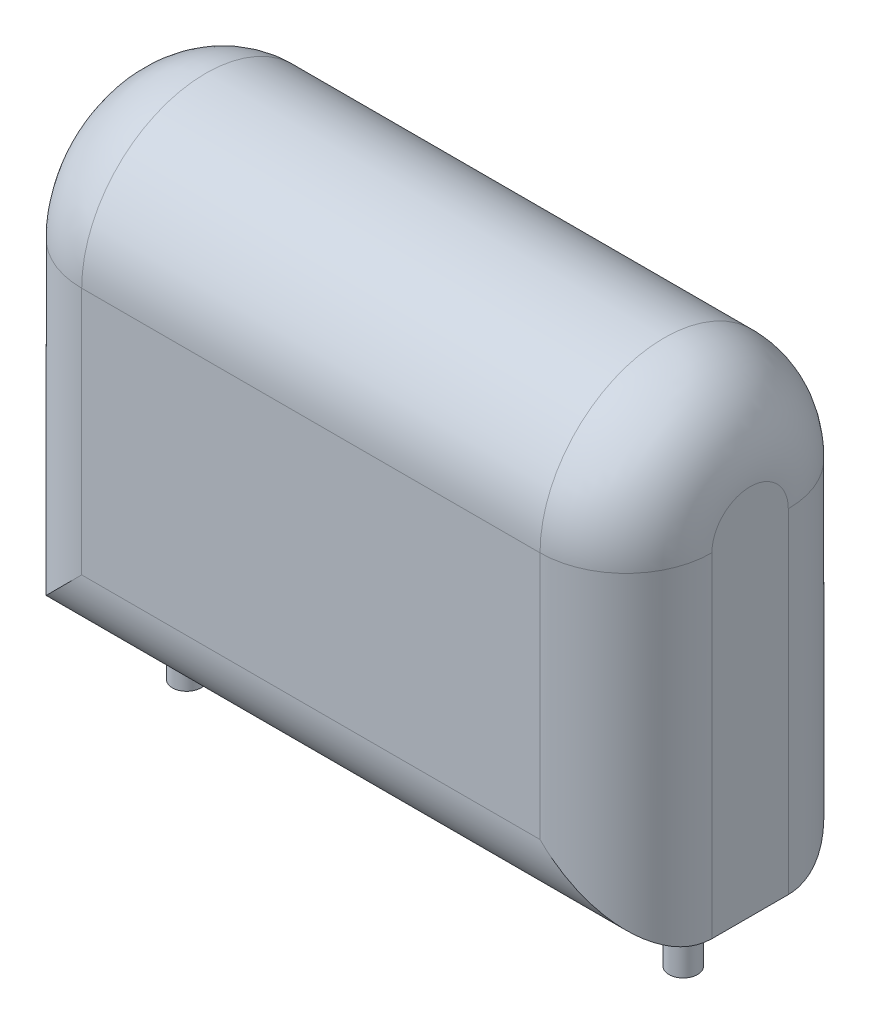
ISO-10303-21;
HEADER;
FILE_DESCRIPTION(('STEP AP214'),'2;1');
FILE_NAME('part.step','',(''),(''),'','','');
FILE_SCHEMA(('AUTOMOTIVE_DESIGN { 1 0 10303 214 1 1 1 1 }'));
ENDSEC;
DATA;
#1=APPLICATION_CONTEXT('core data for automotive mechanical design processes');
#2=APPLICATION_PROTOCOL_DEFINITION('international standard','automotive_design',2000,#1);
#3=PRODUCT_CONTEXT('',#1,'mechanical');
#4=PRODUCT('Part','Part','',(#3));
#5=PRODUCT_RELATED_PRODUCT_CATEGORY('part','',(#4));
#6=PRODUCT_DEFINITION_FORMATION('','',#4);
#7=PRODUCT_DEFINITION_CONTEXT('part definition',#1,'design');
#8=PRODUCT_DEFINITION('design','',#6,#7);
#9=PRODUCT_DEFINITION_SHAPE('','',#8);
#10=(LENGTH_UNIT() NAMED_UNIT(*) SI_UNIT(.MILLI.,.METRE.));
#11=(NAMED_UNIT(*) PLANE_ANGLE_UNIT() SI_UNIT($,.RADIAN.));
#12=(NAMED_UNIT(*) SI_UNIT($,.STERADIAN.) SOLID_ANGLE_UNIT());
#13=UNCERTAINTY_MEASURE_WITH_UNIT(LENGTH_MEASURE(1.E-05),#10,'distance_accuracy_value','');
#14=(GEOMETRIC_REPRESENTATION_CONTEXT(3) GLOBAL_UNCERTAINTY_ASSIGNED_CONTEXT((#13)) GLOBAL_UNIT_ASSIGNED_CONTEXT((#10,
#11,#12)) REPRESENTATION_CONTEXT('',''));
#15=CARTESIAN_POINT('',(0.,0.,0.));
#16=DIRECTION('',(0.,0.,1.));
#17=DIRECTION('',(1.,0.,0.));
#18=AXIS2_PLACEMENT_3D('',#15,#16,#17);
#19=CARTESIAN_POINT('',(6.5,-2.,0.));
#20=DIRECTION('',(0.,1.,0.));
#21=DIRECTION('',(0.,0.,1.));
#22=AXIS2_PLACEMENT_3D('',#19,#20,#21);
#23=CYLINDRICAL_SURFACE('',#22,0.375);
#24=CARTESIAN_POINT('',(6.5,0.,0.));
#25=DIRECTION('',(0.,-1.,0.));
#26=DIRECTION('',(0.,0.,1.));
#27=AXIS2_PLACEMENT_3D('',#24,#25,#26);
#28=CIRCLE('',#27,0.375);
#29=CARTESIAN_POINT('',(6.5,0.,0.375));
#30=VERTEX_POINT('',#29);
#31=EDGE_CURVE('E11',#30,#30,#28,.T.);
#32=ORIENTED_EDGE('',*,*,#31,.T.);
#33=EDGE_LOOP('',(#32));
#34=FACE_BOUND('',#33,.T.);
#35=CARTESIAN_POINT('',(6.5,-2.,0.));
#36=DIRECTION('',(0.,-1.,0.));
#37=DIRECTION('',(0.,0.,1.));
#38=AXIS2_PLACEMENT_3D('',#35,#36,#37);
#39=CIRCLE('',#38,0.375);
#40=CARTESIAN_POINT('',(6.5,-2.,0.375));
#41=VERTEX_POINT('',#40);
#42=EDGE_CURVE('E139',#41,#41,#39,.T.);
#43=ORIENTED_EDGE('',*,*,#42,.F.);
#44=EDGE_LOOP('',(#43));
#45=FACE_BOUND('',#44,.T.);
#46=ADVANCED_FACE('F17',(#34,#45),#23,.T.);
#47=CARTESIAN_POINT('',(-6.5,-2.,0.));
#48=DIRECTION('',(0.,1.,0.));
#49=DIRECTION('',(0.,0.,1.));
#50=AXIS2_PLACEMENT_3D('',#47,#48,#49);
#51=CYLINDRICAL_SURFACE('',#50,0.375);
#52=CARTESIAN_POINT('',(-6.5,0.,0.));
#53=DIRECTION('',(0.,-1.,0.));
#54=DIRECTION('',(0.,0.,1.));
#55=AXIS2_PLACEMENT_3D('',#52,#53,#54);
#56=CIRCLE('',#55,0.375);
#57=CARTESIAN_POINT('',(-6.5,0.,0.375));
#58=VERTEX_POINT('',#57);
#59=EDGE_CURVE('E29',#58,#58,#56,.T.);
#60=ORIENTED_EDGE('',*,*,#59,.T.);
#61=EDGE_LOOP('',(#60));
#62=FACE_BOUND('',#61,.T.);
#63=CARTESIAN_POINT('',(-6.5,-2.,0.));
#64=DIRECTION('',(0.,-1.,0.));
#65=DIRECTION('',(0.,0.,-1.));
#66=AXIS2_PLACEMENT_3D('',#63,#64,#65);
#67=CIRCLE('',#66,0.375);
#68=CARTESIAN_POINT('',(-6.5,-2.,-0.375));
#69=VERTEX_POINT('',#68);
#70=EDGE_CURVE('E136',#69,#69,#67,.T.);
#71=ORIENTED_EDGE('',*,*,#70,.F.);
#72=EDGE_LOOP('',(#71));
#73=FACE_BOUND('',#72,.T.);
#74=ADVANCED_FACE('F229',(#62,#73),#51,.T.);
#75=CARTESIAN_POINT('',(-8.25,0.,3.25));
#76=DIRECTION('',(0.,1.,0.));
#77=DIRECTION('',(0.,0.,1.));
#78=AXIS2_PLACEMENT_3D('',#75,#76,#77);
#79=PLANE('',#78);
#80=ORIENTED_EDGE('',*,*,#59,.F.);
#81=EDGE_LOOP('',(#80));
#82=FACE_BOUND('',#81,.T.);
#83=DIRECTION('',(0.,0.,1.));
#84=VECTOR('',#83,1.);
#85=CARTESIAN_POINT('',(-8.25,0.,-3.25));
#86=LINE('',#85,#84);
#87=CARTESIAN_POINT('',(-8.25,0.,-1.));
#88=VERTEX_POINT('',#87);
#89=CARTESIAN_POINT('',(-8.25,0.,0.999999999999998));
#90=VERTEX_POINT('',#89);
#91=EDGE_CURVE('E38',#88,#90,#86,.T.);
#92=ORIENTED_EDGE('',*,*,#91,.F.);
#93=DIRECTION('',(1.,0.,0.));
#94=VECTOR('',#93,1.);
#95=CARTESIAN_POINT('',(-8.25,0.,-1.));
#96=LINE('',#95,#94);
#97=CARTESIAN_POINT('',(8.25,0.,-1.));
#98=VERTEX_POINT('',#97);
#99=EDGE_CURVE('E148',#88,#98,#96,.T.);
#100=ORIENTED_EDGE('',*,*,#99,.T.);
#101=DIRECTION('',(0.,0.,-1.));
#102=VECTOR('',#101,1.);
#103=CARTESIAN_POINT('',(8.25,0.,-3.25));
#104=LINE('',#103,#102);
#105=CARTESIAN_POINT('',(8.25,0.,0.999999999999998));
#106=VERTEX_POINT('',#105);
#107=EDGE_CURVE('E154',#106,#98,#104,.T.);
#108=ORIENTED_EDGE('',*,*,#107,.F.);
#109=DIRECTION('',(-1.,0.,0.));
#110=VECTOR('',#109,1.);
#111=CARTESIAN_POINT('',(-8.25,0.,1.));
#112=LINE('',#111,#110);
#113=EDGE_CURVE('E153',#106,#90,#112,.T.);
#114=ORIENTED_EDGE('',*,*,#113,.T.);
#115=EDGE_LOOP('',(#92,#100,#108,#114));
#116=FACE_BOUND('',#115,.T.);
#117=ORIENTED_EDGE('',*,*,#31,.F.);
#118=EDGE_LOOP('',(#117));
#119=FACE_BOUND('',#118,.T.);
#120=ADVANCED_FACE('F212',(#82,#116,#119),#79,.F.);
#121=CARTESIAN_POINT('',(-8.25,12.,-3.25));
#122=DIRECTION('',(1.,0.,0.));
#123=DIRECTION('',(0.,0.,-1.));
#124=AXIS2_PLACEMENT_3D('',#121,#122,#123);
#125=PLANE('',#124);
#126=CARTESIAN_POINT('',(-8.25,8.75,0.));
#127=DIRECTION('',(-1.,0.,0.));
#128=DIRECTION('',(0.,0.,-1.));
#129=AXIS2_PLACEMENT_3D('',#126,#127,#128);
#130=CIRCLE('',#129,1.);
#131=CARTESIAN_POINT('',(-8.25,8.75,1.));
#132=VERTEX_POINT('',#131);
#133=CARTESIAN_POINT('',(-8.25,8.75,-1.));
#134=VERTEX_POINT('',#133);
#135=EDGE_CURVE('E160',#132,#134,#130,.T.);
#136=ORIENTED_EDGE('',*,*,#135,.T.);
#137=DIRECTION('',(0.,-1.,0.));
#138=VECTOR('',#137,1.);
#139=CARTESIAN_POINT('',(-8.25,12.,-1.));
#140=LINE('',#139,#138);
#141=EDGE_CURVE('E150',#134,#88,#140,.T.);
#142=ORIENTED_EDGE('',*,*,#141,.T.);
#143=ORIENTED_EDGE('',*,*,#91,.T.);
#144=DIRECTION('',(0.,1.,0.));
#145=VECTOR('',#144,1.);
#146=CARTESIAN_POINT('',(-8.25,12.,1.));
#147=LINE('',#146,#145);
#148=EDGE_CURVE('E151',#90,#132,#147,.T.);
#149=ORIENTED_EDGE('',*,*,#148,.T.);
#150=EDGE_LOOP('',(#136,#142,#143,#149));
#151=FACE_BOUND('',#150,.T.);
#152=ADVANCED_FACE('F209',(#151),#125,.F.);
#153=CARTESIAN_POINT('',(-8.25,12.,3.25));
#154=DIRECTION('',(0.,0.,-1.));
#155=DIRECTION('',(-1.,0.,0.));
#156=AXIS2_PLACEMENT_3D('',#153,#154,#155);
#157=PLANE('',#156);
#158=DIRECTION('',(-1.,0.,0.));
#159=VECTOR('',#158,1.);
#160=CARTESIAN_POINT('',(-8.25,8.75,3.25));
#161=LINE('',#160,#159);
#162=CARTESIAN_POINT('',(6.,8.75,3.25));
#163=VERTEX_POINT('',#162);
#164=CARTESIAN_POINT('',(-6.,8.75,3.25));
#165=VERTEX_POINT('',#164);
#166=EDGE_CURVE('E95',#163,#165,#161,.T.);
#167=ORIENTED_EDGE('',*,*,#166,.T.);
#168=DIRECTION('',(0.,-1.,0.));
#169=VECTOR('',#168,1.);
#170=CARTESIAN_POINT('',(-6.,12.,3.25));
#171=LINE('',#170,#169);
#172=CARTESIAN_POINT('',(-6.,2.25,3.25));
#173=VERTEX_POINT('',#172);
#174=EDGE_CURVE('E167',#165,#173,#171,.T.);
#175=ORIENTED_EDGE('',*,*,#174,.T.);
#176=DIRECTION('',(1.,0.,0.));
#177=VECTOR('',#176,1.);
#178=CARTESIAN_POINT('',(-8.25,2.25,3.25));
#179=LINE('',#178,#177);
#180=CARTESIAN_POINT('',(6.,2.25,3.25));
#181=VERTEX_POINT('',#180);
#182=EDGE_CURVE('E170',#173,#181,#179,.T.);
#183=ORIENTED_EDGE('',*,*,#182,.T.);
#184=DIRECTION('',(0.,1.,0.));
#185=VECTOR('',#184,1.);
#186=CARTESIAN_POINT('',(6.,12.,3.25));
#187=LINE('',#186,#185);
#188=EDGE_CURVE('E157',#181,#163,#187,.T.);
#189=ORIENTED_EDGE('',*,*,#188,.T.);
#190=EDGE_LOOP('',(#167,#175,#183,#189));
#191=FACE_BOUND('',#190,.T.);
#192=ADVANCED_FACE('F206',(#191),#157,.F.);
#193=CARTESIAN_POINT('',(8.25,12.,-3.25));
#194=DIRECTION('',(-1.,0.,0.));
#195=DIRECTION('',(0.,0.,1.));
#196=AXIS2_PLACEMENT_3D('',#193,#194,#195);
#197=PLANE('',#196);
#198=ORIENTED_EDGE('',*,*,#107,.T.);
#199=DIRECTION('',(0.,1.,0.));
#200=VECTOR('',#199,1.);
#201=CARTESIAN_POINT('',(8.25,12.,-1.));
#202=LINE('',#201,#200);
#203=CARTESIAN_POINT('',(8.25,8.75,-1.));
#204=VERTEX_POINT('',#203);
#205=EDGE_CURVE('E158',#98,#204,#202,.T.);
#206=ORIENTED_EDGE('',*,*,#205,.T.);
#207=CARTESIAN_POINT('',(8.25,8.75,0.));
#208=DIRECTION('',(1.,0.,0.));
#209=DIRECTION('',(0.,0.,1.));
#210=AXIS2_PLACEMENT_3D('',#207,#208,#209);
#211=CIRCLE('',#210,1.);
#212=CARTESIAN_POINT('',(8.25,8.75,1.));
#213=VERTEX_POINT('',#212);
#214=EDGE_CURVE('E120',#204,#213,#211,.T.);
#215=ORIENTED_EDGE('',*,*,#214,.T.);
#216=DIRECTION('',(0.,-1.,0.));
#217=VECTOR('',#216,1.);
#218=CARTESIAN_POINT('',(8.25,12.,1.));
#219=LINE('',#218,#217);
#220=EDGE_CURVE('E176',#213,#106,#219,.T.);
#221=ORIENTED_EDGE('',*,*,#220,.T.);
#222=EDGE_LOOP('',(#198,#206,#215,#221));
#223=FACE_BOUND('',#222,.T.);
#224=ADVANCED_FACE('F215',(#223),#197,.F.);
#225=CARTESIAN_POINT('',(-8.25,12.,-3.25));
#226=DIRECTION('',(0.,0.,1.));
#227=DIRECTION('',(1.,0.,0.));
#228=AXIS2_PLACEMENT_3D('',#225,#226,#227);
#229=PLANE('',#228);
#230=DIRECTION('',(-1.,0.,0.));
#231=VECTOR('',#230,1.);
#232=CARTESIAN_POINT('',(-8.25,2.25,-3.25));
#233=LINE('',#232,#231);
#234=CARTESIAN_POINT('',(6.,2.25,-3.25));
#235=VERTEX_POINT('',#234);
#236=CARTESIAN_POINT('',(-6.,2.25,-3.25));
#237=VERTEX_POINT('',#236);
#238=EDGE_CURVE('E178',#235,#237,#233,.T.);
#239=ORIENTED_EDGE('',*,*,#238,.T.);
#240=DIRECTION('',(0.,1.,0.));
#241=VECTOR('',#240,1.);
#242=CARTESIAN_POINT('',(-6.,12.,-3.25));
#243=LINE('',#242,#241);
#244=CARTESIAN_POINT('',(-6.,8.75,-3.25));
#245=VERTEX_POINT('',#244);
#246=EDGE_CURVE('E116',#237,#245,#243,.T.);
#247=ORIENTED_EDGE('',*,*,#246,.T.);
#248=DIRECTION('',(1.,0.,0.));
#249=VECTOR('',#248,1.);
#250=CARTESIAN_POINT('',(8.25,8.75,-3.25));
#251=LINE('',#250,#249);
#252=CARTESIAN_POINT('',(6.,8.75,-3.25));
#253=VERTEX_POINT('',#252);
#254=EDGE_CURVE('E92',#245,#253,#251,.T.);
#255=ORIENTED_EDGE('',*,*,#254,.T.);
#256=DIRECTION('',(0.,-1.,0.));
#257=VECTOR('',#256,1.);
#258=CARTESIAN_POINT('',(6.,12.,-3.25));
#259=LINE('',#258,#257);
#260=EDGE_CURVE('E106',#253,#235,#259,.T.);
#261=ORIENTED_EDGE('',*,*,#260,.T.);
#262=EDGE_LOOP('',(#239,#247,#255,#261));
#263=FACE_BOUND('',#262,.T.);
#264=ADVANCED_FACE('F115',(#263),#229,.F.);
#265=CARTESIAN_POINT('',(-8.25,8.75,0.));
#266=DIRECTION('',(-1.,0.,0.));
#267=DIRECTION('',(0.,0.,1.));
#268=AXIS2_PLACEMENT_3D('',#265,#266,#267);
#269=CYLINDRICAL_SURFACE('',#268,3.25);
#270=CARTESIAN_POINT('',(6.,8.75,0.));
#271=DIRECTION('',(-1.,0.,0.));
#272=DIRECTION('',(0.,0.,1.));
#273=AXIS2_PLACEMENT_3D('',#270,#271,#272);
#274=CIRCLE('',#273,3.25);
#275=EDGE_CURVE('E88',#163,#253,#274,.T.);
#276=ORIENTED_EDGE('',*,*,#275,.T.);
#277=ORIENTED_EDGE('',*,*,#254,.F.);
#278=CARTESIAN_POINT('',(-6.,8.75,0.));
#279=DIRECTION('',(1.,0.,0.));
#280=DIRECTION('',(0.,0.,-1.));
#281=AXIS2_PLACEMENT_3D('',#278,#279,#280);
#282=CIRCLE('',#281,3.25);
#283=EDGE_CURVE('E83',#245,#165,#282,.T.);
#284=ORIENTED_EDGE('',*,*,#283,.T.);
#285=ORIENTED_EDGE('',*,*,#166,.F.);
#286=EDGE_LOOP('',(#276,#277,#284,#285));
#287=FACE_BOUND('',#286,.T.);
#288=ADVANCED_FACE('F90',(#287),#269,.T.);
#289=CARTESIAN_POINT('',(6.,12.,1.));
#290=DIRECTION('',(0.,-1.,0.));
#291=DIRECTION('',(0.,0.,-1.));
#292=AXIS2_PLACEMENT_3D('',#289,#290,#291);
#293=CYLINDRICAL_SURFACE('',#292,2.25);
#294=CARTESIAN_POINT('',(6.,8.75,1.));
#295=DIRECTION('',(0.,1.,0.));
#296=DIRECTION('',(0.,0.,1.));
#297=AXIS2_PLACEMENT_3D('',#294,#295,#296);
#298=CIRCLE('',#297,2.25);
#299=EDGE_CURVE('E182',#163,#213,#298,.T.);
#300=ORIENTED_EDGE('',*,*,#299,.F.);
#301=ORIENTED_EDGE('',*,*,#188,.F.);
#302=CARTESIAN_POINT('',(8.25,0.,0.999999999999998));
#303=CARTESIAN_POINT('',(8.25,0.,2.31801948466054));
#304=CARTESIAN_POINT('',(7.31801948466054,0.931980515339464,3.25));
#305=CARTESIAN_POINT('',(6.,2.25,3.25));
#306=(BOUNDED_CURVE() B_SPLINE_CURVE(3,(#302,#303,#304,#305),.UNSPECIFIED.,.F.,
.F.) B_SPLINE_CURVE_WITH_KNOTS((4,4),(0.,1.5707963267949),
.UNSPECIFIED.) CURVE() GEOMETRIC_REPRESENTATION_ITEM() RATIONAL_B_SPLINE_CURVE((1.,
0.804737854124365,0.804737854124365,1.)) REPRESENTATION_ITEM(''));
#307=EDGE_CURVE('E101',#106,#181,#306,.T.);
#308=ORIENTED_EDGE('',*,*,#307,.F.);
#309=ORIENTED_EDGE('',*,*,#220,.F.);
#310=EDGE_LOOP('',(#300,#301,#308,#309));
#311=FACE_BOUND('',#310,.T.);
#312=ADVANCED_FACE('F218',(#311),#293,.T.);
#313=CARTESIAN_POINT('',(-8.25,2.25,1.));
#314=DIRECTION('',(1.,0.,0.));
#315=DIRECTION('',(0.,0.,-1.));
#316=AXIS2_PLACEMENT_3D('',#313,#314,#315);
#317=CYLINDRICAL_SURFACE('',#316,2.25);
#318=ORIENTED_EDGE('',*,*,#307,.T.);
#319=ORIENTED_EDGE('',*,*,#182,.F.);
#320=CARTESIAN_POINT('',(-8.25,0.,0.999999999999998));
#321=CARTESIAN_POINT('',(-8.25,0.,2.31801948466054));
#322=CARTESIAN_POINT('',(-7.31801948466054,0.931980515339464,3.25));
#323=CARTESIAN_POINT('',(-6.,2.25,3.25));
#324=(BOUNDED_CURVE() B_SPLINE_CURVE(3,(#320,#321,#322,#323),.UNSPECIFIED.,.F.,
.F.) B_SPLINE_CURVE_WITH_KNOTS((4,4),(0.,1.5707963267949),
.UNSPECIFIED.) CURVE() GEOMETRIC_REPRESENTATION_ITEM() RATIONAL_B_SPLINE_CURVE((1.,
0.804737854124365,0.804737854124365,1.)) REPRESENTATION_ITEM(''));
#325=EDGE_CURVE('E124',#90,#173,#324,.T.);
#326=ORIENTED_EDGE('',*,*,#325,.F.);
#327=ORIENTED_EDGE('',*,*,#113,.F.);
#328=EDGE_LOOP('',(#318,#319,#326,#327));
#329=FACE_BOUND('',#328,.T.);
#330=ADVANCED_FACE('F203',(#329),#317,.T.);
#331=CARTESIAN_POINT('',(6.,8.75,0.));
#332=DIRECTION('',(-1.,0.,0.));
#333=DIRECTION('',(0.,0.,1.));
#334=AXIS2_PLACEMENT_3D('',#331,#332,#333);
#335=DEGENERATE_TOROIDAL_SURFACE('',#334,1.,2.25,.T.);
#336=ORIENTED_EDGE('',*,*,#299,.T.);
#337=ORIENTED_EDGE('',*,*,#214,.F.);
#338=CARTESIAN_POINT('',(6.,8.75,-1.));
#339=DIRECTION('',(0.,-1.,0.));
#340=DIRECTION('',(0.,0.,-1.));
#341=AXIS2_PLACEMENT_3D('',#338,#339,#340);
#342=CIRCLE('',#341,2.25);
#343=EDGE_CURVE('E108',#253,#204,#342,.T.);
#344=ORIENTED_EDGE('',*,*,#343,.F.);
#345=ORIENTED_EDGE('',*,*,#275,.F.);
#346=EDGE_LOOP('',(#336,#337,#344,#345));
#347=FACE_BOUND('',#346,.T.);
#348=ADVANCED_FACE('F119',(#347),#335,.T.);
#349=CARTESIAN_POINT('',(-6.,12.,1.));
#350=DIRECTION('',(0.,-1.,0.));
#351=DIRECTION('',(0.,0.,-1.));
#352=AXIS2_PLACEMENT_3D('',#349,#350,#351);
#353=CYLINDRICAL_SURFACE('',#352,2.25);
#354=ORIENTED_EDGE('',*,*,#325,.T.);
#355=ORIENTED_EDGE('',*,*,#174,.F.);
#356=CARTESIAN_POINT('',(-6.,8.75,1.));
#357=DIRECTION('',(0.,1.,0.));
#358=DIRECTION('',(0.,0.,1.));
#359=AXIS2_PLACEMENT_3D('',#356,#357,#358);
#360=CIRCLE('',#359,2.25);
#361=EDGE_CURVE('E122',#132,#165,#360,.T.);
#362=ORIENTED_EDGE('',*,*,#361,.F.);
#363=ORIENTED_EDGE('',*,*,#148,.F.);
#364=EDGE_LOOP('',(#354,#355,#362,#363));
#365=FACE_BOUND('',#364,.T.);
#366=ADVANCED_FACE('F199',(#365),#353,.T.);
#367=CARTESIAN_POINT('',(-6.,8.75,0.));
#368=DIRECTION('',(1.,0.,0.));
#369=DIRECTION('',(0.,0.,-1.));
#370=AXIS2_PLACEMENT_3D('',#367,#368,#369);
#371=DEGENERATE_TOROIDAL_SURFACE('',#370,1.,2.25,.T.);
#372=ORIENTED_EDGE('',*,*,#361,.T.);
#373=ORIENTED_EDGE('',*,*,#283,.F.);
#374=CARTESIAN_POINT('',(-6.,8.75,-1.));
#375=DIRECTION('',(0.,-1.,0.));
#376=DIRECTION('',(0.,0.,-1.));
#377=AXIS2_PLACEMENT_3D('',#374,#375,#376);
#378=CIRCLE('',#377,2.25);
#379=EDGE_CURVE('E126',#134,#245,#378,.T.);
#380=ORIENTED_EDGE('',*,*,#379,.F.);
#381=ORIENTED_EDGE('',*,*,#135,.F.);
#382=EDGE_LOOP('',(#372,#373,#380,#381));
#383=FACE_BOUND('',#382,.T.);
#384=ADVANCED_FACE('F207',(#383),#371,.T.);
#385=CARTESIAN_POINT('',(6.,12.,-1.));
#386=DIRECTION('',(0.,-1.,0.));
#387=DIRECTION('',(0.,0.,-1.));
#388=AXIS2_PLACEMENT_3D('',#385,#386,#387);
#389=CYLINDRICAL_SURFACE('',#388,2.25);
#390=ORIENTED_EDGE('',*,*,#343,.T.);
#391=ORIENTED_EDGE('',*,*,#205,.F.);
#392=CARTESIAN_POINT('',(6.,2.25,-3.25));
#393=CARTESIAN_POINT('',(7.31801948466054,0.931980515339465,-3.25));
#394=CARTESIAN_POINT('',(8.25,0.,-2.31801948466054));
#395=CARTESIAN_POINT('',(8.25,0.,-1.));
#396=(BOUNDED_CURVE() B_SPLINE_CURVE(3,(#392,#393,#394,#395),.UNSPECIFIED.,.F.,
.F.) B_SPLINE_CURVE_WITH_KNOTS((4,4),(1.5707963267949,3.14159265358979),
.UNSPECIFIED.) CURVE() GEOMETRIC_REPRESENTATION_ITEM() RATIONAL_B_SPLINE_CURVE((1.,
0.804737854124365,0.804737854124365,1.)) REPRESENTATION_ITEM(''));
#397=EDGE_CURVE('E110',#235,#98,#396,.T.);
#398=ORIENTED_EDGE('',*,*,#397,.F.);
#399=ORIENTED_EDGE('',*,*,#260,.F.);
#400=EDGE_LOOP('',(#390,#391,#398,#399));
#401=FACE_BOUND('',#400,.T.);
#402=ADVANCED_FACE('F107',(#401),#389,.T.);
#403=CARTESIAN_POINT('',(-8.25,2.25,-1.));
#404=DIRECTION('',(-1.,0.,0.));
#405=DIRECTION('',(0.,0.,1.));
#406=AXIS2_PLACEMENT_3D('',#403,#404,#405);
#407=CYLINDRICAL_SURFACE('',#406,2.25);
#408=ORIENTED_EDGE('',*,*,#397,.T.);
#409=ORIENTED_EDGE('',*,*,#99,.F.);
#410=CARTESIAN_POINT('',(-6.,2.25,-3.25));
#411=CARTESIAN_POINT('',(-7.31801948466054,0.931980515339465,-3.25));
#412=CARTESIAN_POINT('',(-8.25,0.,-2.31801948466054));
#413=CARTESIAN_POINT('',(-8.25,0.,-1.));
#414=(BOUNDED_CURVE() B_SPLINE_CURVE(3,(#410,#411,#412,#413),.UNSPECIFIED.,.F.,
.F.) B_SPLINE_CURVE_WITH_KNOTS((4,4),(4.71238898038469,6.28318530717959),
.UNSPECIFIED.) CURVE() GEOMETRIC_REPRESENTATION_ITEM() RATIONAL_B_SPLINE_CURVE((1.,
0.804737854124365,0.804737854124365,1.)) REPRESENTATION_ITEM(''));
#415=EDGE_CURVE('E21',#237,#88,#414,.T.);
#416=ORIENTED_EDGE('',*,*,#415,.F.);
#417=ORIENTED_EDGE('',*,*,#238,.F.);
#418=EDGE_LOOP('',(#408,#409,#416,#417));
#419=FACE_BOUND('',#418,.T.);
#420=ADVANCED_FACE('F310',(#419),#407,.T.);
#421=CARTESIAN_POINT('',(-6.,12.,-1.));
#422=DIRECTION('',(0.,-1.,0.));
#423=DIRECTION('',(0.,0.,-1.));
#424=AXIS2_PLACEMENT_3D('',#421,#422,#423);
#425=CYLINDRICAL_SURFACE('',#424,2.25);
#426=ORIENTED_EDGE('',*,*,#379,.T.);
#427=ORIENTED_EDGE('',*,*,#246,.F.);
#428=ORIENTED_EDGE('',*,*,#415,.T.);
#429=ORIENTED_EDGE('',*,*,#141,.F.);
#430=EDGE_LOOP('',(#426,#427,#428,#429));
#431=FACE_BOUND('',#430,.T.);
#432=ADVANCED_FACE('F319',(#431),#425,.T.);
#433=CARTESIAN_POINT('',(-6.5,-2.,0.));
#434=DIRECTION('',(0.,-1.,0.));
#435=DIRECTION('',(0.,0.,-1.));
#436=AXIS2_PLACEMENT_3D('',#433,#434,#435);
#437=PLANE('',#436);
#438=ORIENTED_EDGE('',*,*,#70,.T.);
#439=EDGE_LOOP('',(#438));
#440=FACE_BOUND('',#439,.T.);
#441=ADVANCED_FACE('F328',(#440),#437,.T.);
#442=CARTESIAN_POINT('',(6.5,-2.,0.));
#443=DIRECTION('',(0.,1.,0.));
#444=DIRECTION('',(0.,0.,1.));
#445=AXIS2_PLACEMENT_3D('',#442,#443,#444);
#446=PLANE('',#445);
#447=ORIENTED_EDGE('',*,*,#42,.T.);
#448=EDGE_LOOP('',(#447));
#449=FACE_BOUND('',#448,.T.);
#450=ADVANCED_FACE('F19',(#449),#446,.F.);
#451=CLOSED_SHELL('',(#46,#74,#120,#152,#192,#224,#264,#288,#312,#330,#348,#366,#384,#402,#420,
#432,#441,#450));
#452=MANIFOLD_SOLID_BREP('B1',#451);
#453=ADVANCED_BREP_SHAPE_REPRESENTATION('',(#18,#452),#14);
#454=SHAPE_DEFINITION_REPRESENTATION(#9,#453);
ENDSEC;
END-ISO-10303-21;
